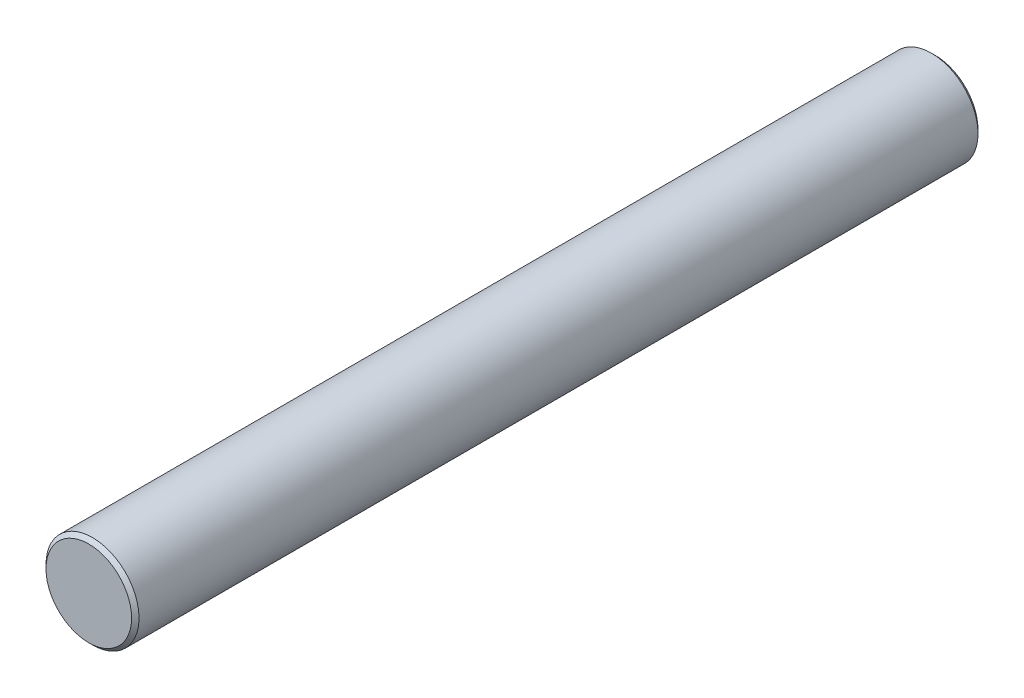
ISO-10303-21;
HEADER;
FILE_DESCRIPTION(('STEP AP214'),'2;1');
FILE_NAME('part.step','',(''),(''),'','','');
FILE_SCHEMA(('AUTOMOTIVE_DESIGN { 1 0 10303 214 1 1 1 1 }'));
ENDSEC;
DATA;
#1=APPLICATION_CONTEXT('core data for automotive mechanical design processes');
#2=APPLICATION_PROTOCOL_DEFINITION('international standard','automotive_design',2000,#1);
#3=PRODUCT_CONTEXT('',#1,'mechanical');
#4=PRODUCT('Part','Part','',(#3));
#5=PRODUCT_RELATED_PRODUCT_CATEGORY('part','',(#4));
#6=PRODUCT_DEFINITION_FORMATION('','',#4);
#7=PRODUCT_DEFINITION_CONTEXT('part definition',#1,'design');
#8=PRODUCT_DEFINITION('design','',#6,#7);
#9=PRODUCT_DEFINITION_SHAPE('','',#8);
#10=(LENGTH_UNIT() NAMED_UNIT(*) SI_UNIT(.MILLI.,.METRE.));
#11=(NAMED_UNIT(*) PLANE_ANGLE_UNIT() SI_UNIT($,.RADIAN.));
#12=(NAMED_UNIT(*) SI_UNIT($,.STERADIAN.) SOLID_ANGLE_UNIT());
#13=UNCERTAINTY_MEASURE_WITH_UNIT(LENGTH_MEASURE(1.E-05),#10,'distance_accuracy_value','');
#14=(GEOMETRIC_REPRESENTATION_CONTEXT(3) GLOBAL_UNCERTAINTY_ASSIGNED_CONTEXT((#13)) GLOBAL_UNIT_ASSIGNED_CONTEXT((#10,
#11,#12)) REPRESENTATION_CONTEXT('',''));
#15=CARTESIAN_POINT('',(0.,0.,0.));
#16=DIRECTION('',(0.,0.,1.));
#17=DIRECTION('',(1.,0.,0.));
#18=AXIS2_PLACEMENT_3D('',#15,#16,#17);
#19=CARTESIAN_POINT('',(0.,0.,455.));
#20=DIRECTION('',(0.,0.,-1.));
#21=DIRECTION('',(-1.,0.,0.));
#22=AXIS2_PLACEMENT_3D('',#19,#20,#21);
#23=CYLINDRICAL_SURFACE('',#22,25.);
#24=CARTESIAN_POINT('',(0.,0.,453.));
#25=DIRECTION('',(0.,0.,1.));
#26=DIRECTION('',(1.,0.,0.));
#27=AXIS2_PLACEMENT_3D('',#24,#25,#26);
#28=CIRCLE('',#27,25.);
#29=CARTESIAN_POINT('',(-25.,0.,453.));
#30=VERTEX_POINT('',#29);
#31=EDGE_CURVE('E48',#30,#30,#28,.F.);
#32=CARTESIAN_POINT('',(0.,0.,2.00000000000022));
#33=DIRECTION('',(0.,0.,1.));
#34=DIRECTION('',(1.,0.,0.));
#35=AXIS2_PLACEMENT_3D('',#32,#33,#34);
#36=CIRCLE('',#35,25.);
#37=CARTESIAN_POINT('',(-25.,0.,2.00000000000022));
#38=VERTEX_POINT('',#37);
#39=EDGE_CURVE('E65',#38,#38,#36,.T.);
#40=CARTESIAN_POINT('',(-25.,0.,453.));
#41=CARTESIAN_POINT('',(-25.,0.,448.302083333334));
#42=CARTESIAN_POINT('',(-25.,0.,443.604166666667));
#43=CARTESIAN_POINT('',(-25.,0.,434.208333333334));
#44=CARTESIAN_POINT('',(-25.,0.,429.510416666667));
#45=CARTESIAN_POINT('',(-25.,0.,420.114583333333));
#46=CARTESIAN_POINT('',(-25.,0.,415.416666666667));
#47=CARTESIAN_POINT('',(-25.,0.,406.020833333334));
#48=CARTESIAN_POINT('',(-25.,0.,401.322916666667));
#49=CARTESIAN_POINT('',(-25.,0.,391.927083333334));
#50=CARTESIAN_POINT('',(-25.,0.,387.229166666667));
#51=CARTESIAN_POINT('',(-25.,0.,377.833333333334));
#52=CARTESIAN_POINT('',(-25.,0.,373.135416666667));
#53=CARTESIAN_POINT('',(-25.,0.,363.739583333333));
#54=CARTESIAN_POINT('',(-25.,0.,359.041666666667));
#55=CARTESIAN_POINT('',(-25.,0.,349.645833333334));
#56=CARTESIAN_POINT('',(-25.,0.,344.947916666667));
#57=CARTESIAN_POINT('',(-25.,0.,335.552083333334));
#58=CARTESIAN_POINT('',(-25.,0.,330.854166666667));
#59=CARTESIAN_POINT('',(-25.,0.,321.458333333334));
#60=CARTESIAN_POINT('',(-25.,0.,316.760416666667));
#61=CARTESIAN_POINT('',(-25.,0.,307.364583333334));
#62=CARTESIAN_POINT('',(-25.,0.,302.666666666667));
#63=CARTESIAN_POINT('',(-25.,0.,293.270833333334));
#64=CARTESIAN_POINT('',(-25.,0.,288.572916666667));
#65=CARTESIAN_POINT('',(-25.,0.,279.177083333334));
#66=CARTESIAN_POINT('',(-25.,0.,274.479166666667));
#67=CARTESIAN_POINT('',(-25.,0.,265.083333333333));
#68=CARTESIAN_POINT('',(-25.,0.,260.385416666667));
#69=CARTESIAN_POINT('',(-25.,0.,250.989583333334));
#70=CARTESIAN_POINT('',(-25.,0.,246.291666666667));
#71=CARTESIAN_POINT('',(-25.,0.,236.895833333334));
#72=CARTESIAN_POINT('',(-25.,0.,232.197916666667));
#73=CARTESIAN_POINT('',(-25.,0.,222.802083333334));
#74=CARTESIAN_POINT('',(-25.,0.,218.104166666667));
#75=CARTESIAN_POINT('',(-25.,0.,208.708333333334));
#76=CARTESIAN_POINT('',(-25.,0.,204.010416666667));
#77=CARTESIAN_POINT('',(-25.,0.,194.614583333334));
#78=CARTESIAN_POINT('',(-25.,0.,189.916666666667));
#79=CARTESIAN_POINT('',(-25.,0.,180.520833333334));
#80=CARTESIAN_POINT('',(-25.,0.,175.822916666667));
#81=CARTESIAN_POINT('',(-25.,0.,166.427083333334));
#82=CARTESIAN_POINT('',(-25.,0.,161.729166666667));
#83=CARTESIAN_POINT('',(-25.,0.,152.333333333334));
#84=CARTESIAN_POINT('',(-25.,0.,147.635416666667));
#85=CARTESIAN_POINT('',(-25.,0.,138.239583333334));
#86=CARTESIAN_POINT('',(-25.,0.,133.541666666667));
#87=CARTESIAN_POINT('',(-25.,0.,124.145833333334));
#88=CARTESIAN_POINT('',(-25.,0.,119.447916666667));
#89=CARTESIAN_POINT('',(-25.,0.,110.052083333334));
#90=CARTESIAN_POINT('',(-25.,0.,105.354166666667));
#91=CARTESIAN_POINT('',(-25.,0.,95.9583333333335));
#92=CARTESIAN_POINT('',(-25.,0.,91.2604166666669));
#93=CARTESIAN_POINT('',(-25.,0.,81.8645833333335));
#94=CARTESIAN_POINT('',(-25.,0.,77.1666666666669));
#95=CARTESIAN_POINT('',(-25.,0.,67.7708333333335));
#96=CARTESIAN_POINT('',(-25.,0.,63.0729166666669));
#97=CARTESIAN_POINT('',(-25.,0.,53.6770833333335));
#98=CARTESIAN_POINT('',(-25.,0.,48.9791666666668));
#99=CARTESIAN_POINT('',(-25.,0.,39.5833333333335));
#100=CARTESIAN_POINT('',(-25.,0.,34.8854166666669));
#101=CARTESIAN_POINT('',(-25.,0.,25.4895833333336));
#102=CARTESIAN_POINT('',(-25.,0.,20.7916666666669));
#103=CARTESIAN_POINT('',(-25.,0.,11.3958333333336));
#104=CARTESIAN_POINT('',(-25.,0.,6.69791666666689));
#105=CARTESIAN_POINT('',(-25.,0.,2.00000000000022));
#106=B_SPLINE_CURVE_WITH_KNOTS('',3,(#40,#41,#42,#43,#44,#45,#46,#47,#48,#49,#50,#51,#52,#53,
#54,#55,#56,#57,#58,#59,#60,#61,#62,#63,#64,#65,#66,#67,#68,#69,#70,#71,#72,#73,#74,#75,#76,#77,
#78,#79,#80,#81,#82,#83,#84,#85,#86,#87,#88,#89,#90,#91,#92,#93,#94,#95,#96,#97,#98,#99,#100,
#101,#102,#103,#104,#105),.UNSPECIFIED.,.F.,.F.,(4,2,2,2,2,2,2,2,2,2,2,2,2,2,2,2,2,2,2,2,2,2,2,
2,2,2,2,2,2,2,2,2,4),(0.,14.09375,28.1875,42.28125,56.375,70.46875,84.5625,98.6562500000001,
112.75,126.84375,140.9375,155.03125,169.125,183.21875,197.3125,211.40625,225.5,239.59375,
253.6875,267.78125,281.875,295.96875,310.0625,324.15625,338.25,352.34375,366.4375,380.53125,
394.625,408.71875,422.8125,436.90625,451.),.UNSPECIFIED.);
#107=EDGE_CURVE('BSEAM41',#30,#38,#106,.T.);
#108=ORIENTED_EDGE('',*,*,#31,.T.);
#109=ORIENTED_EDGE('',*,*,#39,.T.);
#110=ORIENTED_EDGE('',*,*,#107,.T.);
#111=ORIENTED_EDGE('',*,*,#107,.F.);
#112=EDGE_LOOP('',(#108,#110,#109,#111));
#113=FACE_BOUND('',#112,.T.);
#114=ADVANCED_FACE('F41',(#113),#23,.T.);
#115=CARTESIAN_POINT('',(0.,0.,455.));
#116=DIRECTION('',(0.,0.,1.));
#117=DIRECTION('',(1.,0.,0.));
#118=AXIS2_PLACEMENT_3D('',#115,#116,#117);
#119=PLANE('',#118);
#120=CARTESIAN_POINT('',(0.,0.,455.));
#121=DIRECTION('',(0.,0.,1.));
#122=DIRECTION('',(1.,0.,0.));
#123=AXIS2_PLACEMENT_3D('',#120,#121,#122);
#124=CIRCLE('',#123,23.0000000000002);
#125=CARTESIAN_POINT('',(23.0000000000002,0.,455.));
#126=VERTEX_POINT('',#125);
#127=EDGE_CURVE('E61',#126,#126,#124,.T.);
#128=ORIENTED_EDGE('',*,*,#127,.T.);
#129=EDGE_LOOP('',(#128));
#130=FACE_BOUND('',#129,.T.);
#131=ADVANCED_FACE('F81',(#130),#119,.T.);
#132=CARTESIAN_POINT('',(0.,0.,0.));
#133=DIRECTION('',(0.,0.,1.));
#134=DIRECTION('',(1.,0.,0.));
#135=AXIS2_PLACEMENT_3D('',#132,#133,#134);
#136=PLANE('',#135);
#137=CARTESIAN_POINT('',(0.,0.,0.));
#138=DIRECTION('',(0.,0.,1.));
#139=DIRECTION('',(1.,0.,0.));
#140=AXIS2_PLACEMENT_3D('',#137,#138,#139);
#141=CIRCLE('',#140,22.9999999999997);
#142=CARTESIAN_POINT('',(22.9999999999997,0.,0.));
#143=VERTEX_POINT('',#142);
#144=EDGE_CURVE('E11',#143,#143,#141,.F.);
#145=ORIENTED_EDGE('',*,*,#144,.T.);
#146=EDGE_LOOP('',(#145));
#147=FACE_BOUND('',#146,.T.);
#148=CARTESIAN_POINT('',(0.,0.,0.));
#149=DIRECTION('',(0.,0.,-1.));
#150=DIRECTION('',(-1.,0.,0.));
#151=AXIS2_PLACEMENT_3D('',#148,#149,#150);
#152=CIRCLE('',#151,7.);
#153=CARTESIAN_POINT('',(-7.,0.,0.));
#154=VERTEX_POINT('',#153);
#155=EDGE_CURVE('E62',#154,#154,#152,.T.);
#156=ORIENTED_EDGE('',*,*,#155,.F.);
#157=EDGE_LOOP('',(#156));
#158=FACE_BOUND('',#157,.T.);
#159=ADVANCED_FACE('F55',(#147,#158),#136,.F.);
#160=CARTESIAN_POINT('',(0.,0.,38.));
#161=DIRECTION('',(0.,0.,-1.));
#162=DIRECTION('',(-1.,0.,0.));
#163=AXIS2_PLACEMENT_3D('',#160,#161,#162);
#164=CONICAL_SURFACE('',#163,6.99999999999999,1.02974425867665);
#165=CARTESIAN_POINT('',(0.,0.,42.2060243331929));
#166=VERTEX_POINT('',#165);
#167=VERTEX_LOOP('',#166);
#168=FACE_BOUND('',#167,.T.);
#169=CARTESIAN_POINT('',(0.,0.,38.));
#170=DIRECTION('',(0.,0.,-1.));
#171=DIRECTION('',(-1.,0.,0.));
#172=AXIS2_PLACEMENT_3D('',#169,#170,#171);
#173=CIRCLE('',#172,6.99999999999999);
#174=CARTESIAN_POINT('',(-6.99999999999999,0.,38.));
#175=VERTEX_POINT('',#174);
#176=EDGE_CURVE('E59',#175,#175,#173,.T.);
#177=ORIENTED_EDGE('',*,*,#176,.T.);
#178=EDGE_LOOP('',(#177));
#179=FACE_BOUND('',#178,.T.);
#180=ADVANCED_FACE('F51',(#168,#179),#164,.F.);
#181=CARTESIAN_POINT('',(0.,0.,0.));
#182=DIRECTION('',(0.,0.,-1.));
#183=DIRECTION('',(-1.,0.,0.));
#184=AXIS2_PLACEMENT_3D('',#181,#182,#183);
#185=CYLINDRICAL_SURFACE('',#184,6.99999999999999);
#186=ORIENTED_EDGE('',*,*,#176,.F.);
#187=EDGE_LOOP('',(#186));
#188=FACE_BOUND('',#187,.T.);
#189=ORIENTED_EDGE('',*,*,#155,.T.);
#190=EDGE_LOOP('',(#189));
#191=FACE_BOUND('',#190,.T.);
#192=ADVANCED_FACE('F54',(#188,#191),#185,.F.);
#193=CARTESIAN_POINT('',(0.,0.,455.));
#194=DIRECTION('',(0.,0.,-1.));
#195=DIRECTION('',(-1.,0.,0.));
#196=AXIS2_PLACEMENT_3D('',#193,#194,#195);
#197=CONICAL_SURFACE('',#196,23.0000000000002,0.785398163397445);
#198=ORIENTED_EDGE('',*,*,#31,.F.);
#199=EDGE_LOOP('',(#198));
#200=FACE_BOUND('',#199,.T.);
#201=ORIENTED_EDGE('',*,*,#127,.F.);
#202=EDGE_LOOP('',(#201));
#203=FACE_BOUND('',#202,.T.);
#204=ADVANCED_FACE('F76',(#200,#203),#197,.T.);
#205=CARTESIAN_POINT('',(0.,0.,2.00000000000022));
#206=DIRECTION('',(0.,0.,1.));
#207=DIRECTION('',(1.,0.,0.));
#208=AXIS2_PLACEMENT_3D('',#205,#206,#207);
#209=CONICAL_SURFACE('',#208,25.,0.785398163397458);
#210=ORIENTED_EDGE('',*,*,#144,.F.);
#211=EDGE_LOOP('',(#210));
#212=FACE_BOUND('',#211,.T.);
#213=ORIENTED_EDGE('',*,*,#39,.F.);
#214=EDGE_LOOP('',(#213));
#215=FACE_BOUND('',#214,.T.);
#216=ADVANCED_FACE('F43',(#212,#215),#209,.T.);
#217=CLOSED_SHELL('',(#114,#131,#159,#180,#192,#204,#216));
#218=MANIFOLD_SOLID_BREP('B2',#217);
#219=ADVANCED_BREP_SHAPE_REPRESENTATION('',(#18,#218),#14);
#220=SHAPE_DEFINITION_REPRESENTATION(#9,#219);
ENDSEC;
END-ISO-10303-21;
